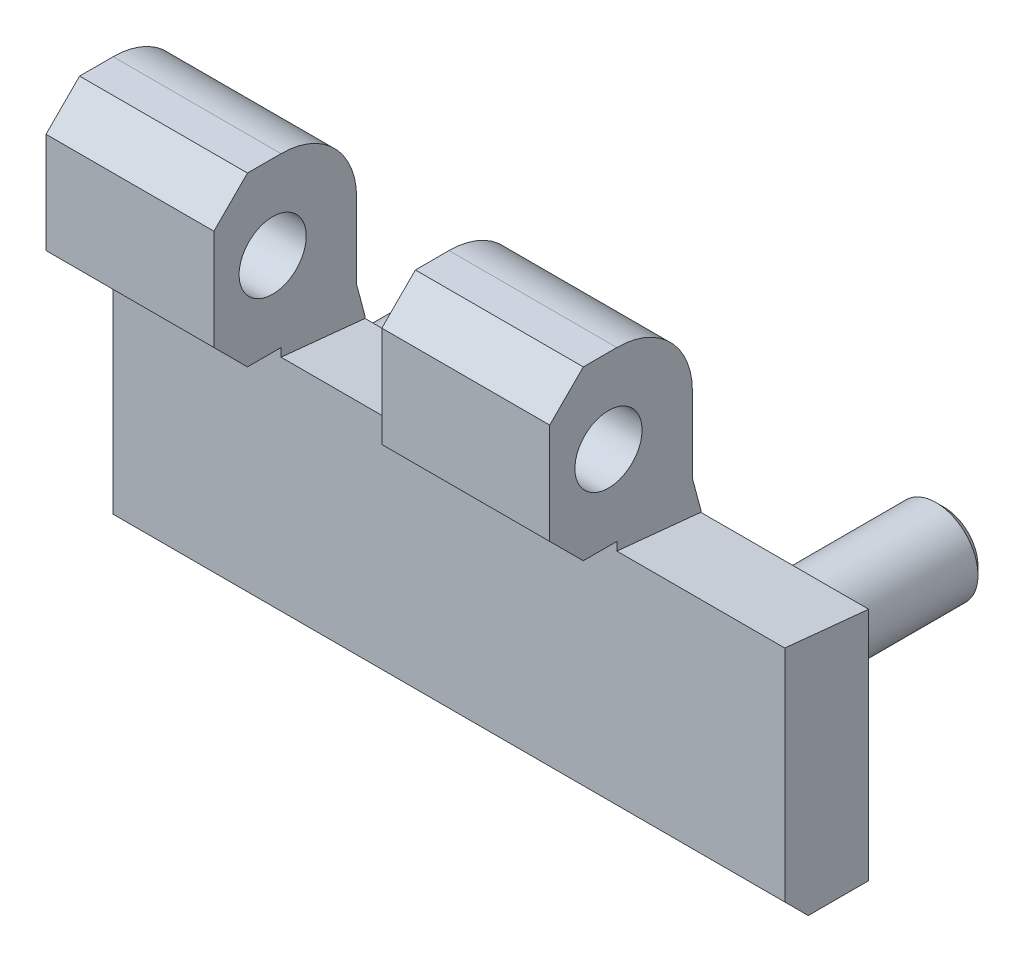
ISO-10303-21;
HEADER;
FILE_DESCRIPTION(('STEP AP214'),'2;1');
FILE_NAME('part.step','',(''),(''),'','','');
FILE_SCHEMA(('AUTOMOTIVE_DESIGN { 1 0 10303 214 1 1 1 1 }'));
ENDSEC;
DATA;
#1=APPLICATION_CONTEXT('core data for automotive mechanical design processes');
#2=APPLICATION_PROTOCOL_DEFINITION('international standard','automotive_design',2000,#1);
#3=PRODUCT_CONTEXT('',#1,'mechanical');
#4=PRODUCT('Part','Part','',(#3));
#5=PRODUCT_RELATED_PRODUCT_CATEGORY('part','',(#4));
#6=PRODUCT_DEFINITION_FORMATION('','',#4);
#7=PRODUCT_DEFINITION_CONTEXT('part definition',#1,'design');
#8=PRODUCT_DEFINITION('design','',#6,#7);
#9=PRODUCT_DEFINITION_SHAPE('','',#8);
#10=(LENGTH_UNIT() NAMED_UNIT(*) SI_UNIT(.MILLI.,.METRE.));
#11=(NAMED_UNIT(*) PLANE_ANGLE_UNIT() SI_UNIT($,.RADIAN.));
#12=(NAMED_UNIT(*) SI_UNIT($,.STERADIAN.) SOLID_ANGLE_UNIT());
#13=UNCERTAINTY_MEASURE_WITH_UNIT(LENGTH_MEASURE(1.E-05),#10,'distance_accuracy_value','');
#14=(GEOMETRIC_REPRESENTATION_CONTEXT(3) GLOBAL_UNCERTAINTY_ASSIGNED_CONTEXT((#13)) GLOBAL_UNIT_ASSIGNED_CONTEXT((#10,
#11,#12)) REPRESENTATION_CONTEXT('',''));
#15=CARTESIAN_POINT('',(0.,0.,0.));
#16=DIRECTION('',(0.,0.,1.));
#17=DIRECTION('',(1.,0.,0.));
#18=AXIS2_PLACEMENT_3D('',#15,#16,#17);
#19=CARTESIAN_POINT('',(-7.5,6.5,0.));
#20=DIRECTION('',(0.,0.995037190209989,-0.099503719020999));
#21=DIRECTION('',(0.,0.099503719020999,0.995037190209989));
#22=AXIS2_PLACEMENT_3D('',#19,#20,#21);
#23=PLANE('',#22);
#24=DIRECTION('',(0.,-0.099503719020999,-0.995037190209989));
#25=VECTOR('',#24,1.);
#26=CARTESIAN_POINT('',(2.5,6.5,0.));
#27=LINE('',#26,#25);
#28=CARTESIAN_POINT('',(2.5,7.,5.));
#29=VERTEX_POINT('',#28);
#30=CARTESIAN_POINT('',(2.5,6.5,0.));
#31=VERTEX_POINT('',#30);
#32=EDGE_CURVE('E29',#29,#31,#27,.T.);
#33=ORIENTED_EDGE('',*,*,#32,.F.);
#34=DIRECTION('',(1.,0.,0.));
#35=VECTOR('',#34,1.);
#36=CARTESIAN_POINT('',(-7.5,7.,5.));
#37=LINE('',#36,#35);
#38=CARTESIAN_POINT('',(12.5,7.,5.));
#39=VERTEX_POINT('',#38);
#40=EDGE_CURVE('E403',#29,#39,#37,.T.);
#41=ORIENTED_EDGE('',*,*,#40,.T.);
#42=DIRECTION('',(0.,-0.099503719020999,-0.995037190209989));
#43=VECTOR('',#42,1.);
#44=CARTESIAN_POINT('',(12.5,6.5,0.));
#45=LINE('',#44,#43);
#46=CARTESIAN_POINT('',(12.5,6.5,0.));
#47=VERTEX_POINT('',#46);
#48=EDGE_CURVE('E369',#39,#47,#45,.T.);
#49=ORIENTED_EDGE('',*,*,#48,.T.);
#50=DIRECTION('',(1.,0.,0.));
#51=VECTOR('',#50,1.);
#52=CARTESIAN_POINT('',(-7.5,6.5,0.));
#53=LINE('',#52,#51);
#54=EDGE_CURVE('E36',#31,#47,#53,.T.);
#55=ORIENTED_EDGE('',*,*,#54,.F.);
#56=EDGE_LOOP('',(#33,#41,#49,#55));
#57=FACE_BOUND('',#56,.T.);
#58=ADVANCED_FACE('F14',(#57),#23,.T.);
#59=CARTESIAN_POINT('',(-7.5,-7.5,3.6));
#60=DIRECTION('',(0.,-1.,0.));
#61=DIRECTION('',(1.,0.,0.));
#62=AXIS2_PLACEMENT_3D('',#59,#60,#61);
#63=PLANE('',#62);
#64=DIRECTION('',(1.,0.,0.));
#65=VECTOR('',#64,1.);
#66=CARTESIAN_POINT('',(-7.5,-7.5,0.));
#67=LINE('',#66,#65);
#68=CARTESIAN_POINT('',(-7.5,-7.5,0.));
#69=VERTEX_POINT('',#68);
#70=CARTESIAN_POINT('',(32.5,-7.5,0.));
#71=VERTEX_POINT('',#70);
#72=EDGE_CURVE('E407',#69,#71,#67,.T.);
#73=ORIENTED_EDGE('',*,*,#72,.T.);
#74=DIRECTION('',(0.,0.,-1.));
#75=VECTOR('',#74,1.);
#76=CARTESIAN_POINT('',(32.5,-7.5,3.6));
#77=LINE('',#76,#75);
#78=CARTESIAN_POINT('',(32.5,-7.5,3.6));
#79=VERTEX_POINT('',#78);
#80=EDGE_CURVE('E374',#79,#71,#77,.T.);
#81=ORIENTED_EDGE('',*,*,#80,.F.);
#82=DIRECTION('',(1.,0.,0.));
#83=VECTOR('',#82,1.);
#84=CARTESIAN_POINT('',(-7.5,-7.5,3.6));
#85=LINE('',#84,#83);
#86=CARTESIAN_POINT('',(-7.5,-7.5,3.6));
#87=VERTEX_POINT('',#86);
#88=EDGE_CURVE('E396',#87,#79,#85,.T.);
#89=ORIENTED_EDGE('',*,*,#88,.F.);
#90=DIRECTION('',(0.,0.,-1.));
#91=VECTOR('',#90,1.);
#92=CARTESIAN_POINT('',(-7.5,-7.5,3.6));
#93=LINE('',#92,#91);
#94=EDGE_CURVE('E387',#87,#69,#93,.T.);
#95=ORIENTED_EDGE('',*,*,#94,.T.);
#96=EDGE_LOOP('',(#73,#81,#89,#95));
#97=FACE_BOUND('',#96,.T.);
#98=ADVANCED_FACE('F16',(#97),#63,.T.);
#99=CARTESIAN_POINT('',(-7.5,-7.5,0.));
#100=DIRECTION('',(0.,0.,-1.));
#101=DIRECTION('',(-1.,0.,0.));
#102=AXIS2_PLACEMENT_3D('',#99,#100,#101);
#103=PLANE('',#102);
#104=CARTESIAN_POINT('',(0.,0.,0.));
#105=DIRECTION('',(0.,0.,-1.));
#106=DIRECTION('',(-1.,0.,0.));
#107=AXIS2_PLACEMENT_3D('',#104,#105,#106);
#108=CIRCLE('',#107,2.5);
#109=CARTESIAN_POINT('',(-2.5,0.,0.));
#110=VERTEX_POINT('',#109);
#111=EDGE_CURVE('E9',#110,#110,#108,.T.);
#112=ORIENTED_EDGE('',*,*,#111,.F.);
#113=EDGE_LOOP('',(#112));
#114=FACE_BOUND('',#113,.T.);
#115=CARTESIAN_POINT('',(25.,0.,0.));
#116=DIRECTION('',(0.,0.,-1.));
#117=DIRECTION('',(-1.,0.,0.));
#118=AXIS2_PLACEMENT_3D('',#115,#116,#117);
#119=CIRCLE('',#118,2.5);
#120=CARTESIAN_POINT('',(22.5,0.,0.));
#121=VERTEX_POINT('',#120);
#122=EDGE_CURVE('E22',#121,#121,#119,.T.);
#123=ORIENTED_EDGE('',*,*,#122,.F.);
#124=EDGE_LOOP('',(#123));
#125=FACE_BOUND('',#124,.T.);
#126=DIRECTION('',(0.,1.,0.));
#127=VECTOR('',#126,1.);
#128=CARTESIAN_POINT('',(-7.5,-7.5,0.));
#129=LINE('',#128,#127);
#130=CARTESIAN_POINT('',(-7.5,6.6339745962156,0.));
#131=VERTEX_POINT('',#130);
#132=EDGE_CURVE('E194',#69,#131,#129,.T.);
#133=ORIENTED_EDGE('',*,*,#132,.T.);
#134=DIRECTION('',(1.,0.,0.));
#135=VECTOR('',#134,1.);
#136=CARTESIAN_POINT('',(-7.5,6.6339745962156,0.));
#137=LINE('',#136,#135);
#138=CARTESIAN_POINT('',(2.5,6.6339745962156,0.));
#139=VERTEX_POINT('',#138);
#140=EDGE_CURVE('E191',#131,#139,#137,.T.);
#141=ORIENTED_EDGE('',*,*,#140,.T.);
#142=DIRECTION('',(0.,1.,0.));
#143=VECTOR('',#142,1.);
#144=CARTESIAN_POINT('',(2.5,4.5,0.));
#145=LINE('',#144,#143);
#146=EDGE_CURVE('E180',#31,#139,#145,.T.);
#147=ORIENTED_EDGE('',*,*,#146,.F.);
#148=ORIENTED_EDGE('',*,*,#54,.T.);
#149=DIRECTION('',(0.,1.,0.));
#150=VECTOR('',#149,1.);
#151=CARTESIAN_POINT('',(12.5,4.5,0.));
#152=LINE('',#151,#150);
#153=CARTESIAN_POINT('',(12.5,6.6339745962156,0.));
#154=VERTEX_POINT('',#153);
#155=EDGE_CURVE('E284',#47,#154,#152,.T.);
#156=ORIENTED_EDGE('',*,*,#155,.T.);
#157=DIRECTION('',(-1.,0.,0.));
#158=VECTOR('',#157,1.);
#159=CARTESIAN_POINT('',(22.5,6.6339745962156,0.));
#160=LINE('',#159,#158);
#161=CARTESIAN_POINT('',(22.5,6.6339745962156,0.));
#162=VERTEX_POINT('',#161);
#163=EDGE_CURVE('E366',#162,#154,#160,.T.);
#164=ORIENTED_EDGE('',*,*,#163,.F.);
#165=DIRECTION('',(0.,1.,0.));
#166=VECTOR('',#165,1.);
#167=CARTESIAN_POINT('',(22.5,4.5,0.));
#168=LINE('',#167,#166);
#169=CARTESIAN_POINT('',(22.5,6.5,0.));
#170=VERTEX_POINT('',#169);
#171=EDGE_CURVE('E319',#170,#162,#168,.T.);
#172=ORIENTED_EDGE('',*,*,#171,.F.);
#173=CARTESIAN_POINT('',(32.5,6.5,0.));
#174=VERTEX_POINT('',#173);
#175=EDGE_CURVE('E405',#170,#174,#53,.T.);
#176=ORIENTED_EDGE('',*,*,#175,.T.);
#177=DIRECTION('',(0.,1.,0.));
#178=VECTOR('',#177,1.);
#179=CARTESIAN_POINT('',(32.5,-7.5,0.));
#180=LINE('',#179,#178);
#181=EDGE_CURVE('E375',#71,#174,#180,.T.);
#182=ORIENTED_EDGE('',*,*,#181,.F.);
#183=ORIENTED_EDGE('',*,*,#72,.F.);
#184=EDGE_LOOP('',(#133,#141,#147,#148,#156,#164,#172,#176,#182,#183));
#185=FACE_BOUND('',#184,.T.);
#186=ADVANCED_FACE('F192',(#114,#125,#185),#103,.T.);
#187=DIRECTION('',(0.,-0.099503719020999,-0.995037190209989));
#188=VECTOR('',#187,1.);
#189=CARTESIAN_POINT('',(22.5,6.5,0.));
#190=LINE('',#189,#188);
#191=CARTESIAN_POINT('',(22.5,7.,5.));
#192=VERTEX_POINT('',#191);
#193=EDGE_CURVE('E372',#192,#170,#190,.T.);
#194=ORIENTED_EDGE('',*,*,#193,.F.);
#195=CARTESIAN_POINT('',(32.5,7.,5.));
#196=VERTEX_POINT('',#195);
#197=EDGE_CURVE('E402',#192,#196,#37,.T.);
#198=ORIENTED_EDGE('',*,*,#197,.T.);
#199=DIRECTION('',(0.,0.099503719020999,0.995037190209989));
#200=VECTOR('',#199,1.);
#201=CARTESIAN_POINT('',(32.5,6.5,0.));
#202=LINE('',#201,#200);
#203=EDGE_CURVE('E378',#174,#196,#202,.T.);
#204=ORIENTED_EDGE('',*,*,#203,.F.);
#205=ORIENTED_EDGE('',*,*,#175,.F.);
#206=EDGE_LOOP('',(#194,#198,#204,#205));
#207=FACE_BOUND('',#206,.T.);
#208=ADVANCED_FACE('F414',(#207),#23,.T.);
#209=CARTESIAN_POINT('',(-7.5,7.,5.));
#210=DIRECTION('',(0.,0.,1.));
#211=DIRECTION('',(1.,0.,0.));
#212=AXIS2_PLACEMENT_3D('',#209,#210,#211);
#213=PLANE('',#212);
#214=DIRECTION('',(0.,-1.,0.));
#215=VECTOR('',#214,1.);
#216=CARTESIAN_POINT('',(-7.5,7.,5.));
#217=LINE('',#216,#215);
#218=CARTESIAN_POINT('',(-7.5,7.5,5.));
#219=VERTEX_POINT('',#218);
#220=CARTESIAN_POINT('',(-7.5,-6.1,5.));
#221=VERTEX_POINT('',#220);
#222=EDGE_CURVE('E391',#219,#221,#217,.T.);
#223=ORIENTED_EDGE('',*,*,#222,.T.);
#224=DIRECTION('',(1.,0.,0.));
#225=VECTOR('',#224,1.);
#226=CARTESIAN_POINT('',(-7.5,-6.1,5.));
#227=LINE('',#226,#225);
#228=CARTESIAN_POINT('',(32.5,-6.1,5.));
#229=VERTEX_POINT('',#228);
#230=EDGE_CURVE('E400',#221,#229,#227,.T.);
#231=ORIENTED_EDGE('',*,*,#230,.T.);
#232=DIRECTION('',(0.,-1.,0.));
#233=VECTOR('',#232,1.);
#234=CARTESIAN_POINT('',(32.5,7.,5.));
#235=LINE('',#234,#233);
#236=EDGE_CURVE('E381',#196,#229,#235,.T.);
#237=ORIENTED_EDGE('',*,*,#236,.F.);
#238=ORIENTED_EDGE('',*,*,#197,.F.);
#239=DIRECTION('',(0.,-1.,0.));
#240=VECTOR('',#239,1.);
#241=CARTESIAN_POINT('',(22.5,7.5,5.));
#242=LINE('',#241,#240);
#243=CARTESIAN_POINT('',(22.5,7.5,5.));
#244=VERTEX_POINT('',#243);
#245=EDGE_CURVE('E337',#244,#192,#242,.T.);
#246=ORIENTED_EDGE('',*,*,#245,.F.);
#247=DIRECTION('',(-1.,0.,0.));
#248=VECTOR('',#247,1.);
#249=CARTESIAN_POINT('',(22.5,7.5,5.));
#250=LINE('',#249,#248);
#251=CARTESIAN_POINT('',(12.5,7.5,5.));
#252=VERTEX_POINT('',#251);
#253=EDGE_CURVE('E342',#244,#252,#250,.T.);
#254=ORIENTED_EDGE('',*,*,#253,.T.);
#255=DIRECTION('',(0.,-1.,0.));
#256=VECTOR('',#255,1.);
#257=CARTESIAN_POINT('',(12.5,7.5,5.));
#258=LINE('',#257,#256);
#259=EDGE_CURVE('E311',#252,#39,#258,.T.);
#260=ORIENTED_EDGE('',*,*,#259,.T.);
#261=ORIENTED_EDGE('',*,*,#40,.F.);
#262=DIRECTION('',(0.,-1.,0.));
#263=VECTOR('',#262,1.);
#264=CARTESIAN_POINT('',(2.5,7.5,5.));
#265=LINE('',#264,#263);
#266=CARTESIAN_POINT('',(2.5,7.5,5.));
#267=VERTEX_POINT('',#266);
#268=EDGE_CURVE('E235',#267,#29,#265,.T.);
#269=ORIENTED_EDGE('',*,*,#268,.F.);
#270=DIRECTION('',(1.,0.,0.));
#271=VECTOR('',#270,1.);
#272=CARTESIAN_POINT('',(-7.5,7.5,5.));
#273=LINE('',#272,#271);
#274=EDGE_CURVE('E268',#219,#267,#273,.T.);
#275=ORIENTED_EDGE('',*,*,#274,.F.);
#276=EDGE_LOOP('',(#223,#231,#237,#238,#246,#254,#260,#261,#269,#275));
#277=FACE_BOUND('',#276,.T.);
#278=ADVANCED_FACE('F422',(#277),#213,.T.);
#279=CARTESIAN_POINT('',(-7.5,-6.1,5.));
#280=DIRECTION('',(0.,-0.707106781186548,0.707106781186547));
#281=DIRECTION('',(0.,-0.707106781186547,-0.707106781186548));
#282=AXIS2_PLACEMENT_3D('',#279,#280,#281);
#283=PLANE('',#282);
#284=ORIENTED_EDGE('',*,*,#88,.T.);
#285=DIRECTION('',(0.,-0.707106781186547,-0.707106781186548));
#286=VECTOR('',#285,1.);
#287=CARTESIAN_POINT('',(32.5,-6.1,5.));
#288=LINE('',#287,#286);
#289=EDGE_CURVE('E384',#229,#79,#288,.T.);
#290=ORIENTED_EDGE('',*,*,#289,.F.);
#291=ORIENTED_EDGE('',*,*,#230,.F.);
#292=DIRECTION('',(0.,-0.707106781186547,-0.707106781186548));
#293=VECTOR('',#292,1.);
#294=CARTESIAN_POINT('',(-7.5,-6.1,5.));
#295=LINE('',#294,#293);
#296=EDGE_CURVE('E393',#221,#87,#295,.T.);
#297=ORIENTED_EDGE('',*,*,#296,.T.);
#298=EDGE_LOOP('',(#284,#290,#291,#297));
#299=FACE_BOUND('',#298,.T.);
#300=ADVANCED_FACE('F434',(#299),#283,.T.);
#301=CARTESIAN_POINT('',(-7.5,-7.5,0.));
#302=DIRECTION('',(1.,0.,0.));
#303=DIRECTION('',(0.,1.,0.));
#304=AXIS2_PLACEMENT_3D('',#301,#302,#303);
#305=PLANE('',#304);
#306=ORIENTED_EDGE('',*,*,#296,.F.);
#307=ORIENTED_EDGE('',*,*,#222,.F.);
#308=DIRECTION('',(0.,0.,-1.));
#309=VECTOR('',#308,1.);
#310=CARTESIAN_POINT('',(-7.5,7.5,7.));
#311=LINE('',#310,#309);
#312=CARTESIAN_POINT('',(-7.5,7.5,7.));
#313=VERTEX_POINT('',#312);
#314=EDGE_CURVE('E262',#313,#219,#311,.T.);
#315=ORIENTED_EDGE('',*,*,#314,.F.);
#316=DIRECTION('',(0.,-0.707106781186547,-0.707106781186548));
#317=VECTOR('',#316,1.);
#318=CARTESIAN_POINT('',(-7.5,9.5,9.));
#319=LINE('',#318,#317);
#320=CARTESIAN_POINT('',(-7.5,9.5,9.));
#321=VERTEX_POINT('',#320);
#322=EDGE_CURVE('E259',#321,#313,#319,.T.);
#323=ORIENTED_EDGE('',*,*,#322,.F.);
#324=DIRECTION('',(0.,-1.,0.));
#325=VECTOR('',#324,1.);
#326=CARTESIAN_POINT('',(-7.5,15.5,9.));
#327=LINE('',#326,#325);
#328=CARTESIAN_POINT('',(-7.5,15.5,9.));
#329=VERTEX_POINT('',#328);
#330=EDGE_CURVE('E256',#329,#321,#327,.T.);
#331=ORIENTED_EDGE('',*,*,#330,.F.);
#332=DIRECTION('',(0.,-0.707106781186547,0.707106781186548));
#333=VECTOR('',#332,1.);
#334=CARTESIAN_POINT('',(-7.5,17.5,7.));
#335=LINE('',#334,#333);
#336=CARTESIAN_POINT('',(-7.5,17.5,7.));
#337=VERTEX_POINT('',#336);
#338=EDGE_CURVE('E253',#337,#329,#335,.T.);
#339=ORIENTED_EDGE('',*,*,#338,.F.);
#340=DIRECTION('',(0.,0.,1.));
#341=VECTOR('',#340,1.);
#342=CARTESIAN_POINT('',(-7.5,17.5,5.));
#343=LINE('',#342,#341);
#344=CARTESIAN_POINT('',(-7.5,17.5,5.));
#345=VERTEX_POINT('',#344);
#346=EDGE_CURVE('E250',#345,#337,#343,.T.);
#347=ORIENTED_EDGE('',*,*,#346,.F.);
#348=CARTESIAN_POINT('',(-7.5,13.0000000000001,4.99999999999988));
#349=DIRECTION('',(1.,0.,0.));
#350=DIRECTION('',(0.,-1.,0.));
#351=AXIS2_PLACEMENT_3D('',#348,#349,#350);
#352=CIRCLE('',#351,4.49999999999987);
#353=CARTESIAN_POINT('',(-7.5,13.,0.5));
#354=VERTEX_POINT('',#353);
#355=EDGE_CURVE('E247',#354,#345,#352,.T.);
#356=ORIENTED_EDGE('',*,*,#355,.F.);
#357=DIRECTION('',(0.,1.,0.));
#358=VECTOR('',#357,1.);
#359=CARTESIAN_POINT('',(-7.5,8.5,0.5));
#360=LINE('',#359,#358);
#361=CARTESIAN_POINT('',(-7.5,8.5,0.5));
#362=VERTEX_POINT('',#361);
#363=EDGE_CURVE('E244',#362,#354,#360,.T.);
#364=ORIENTED_EDGE('',*,*,#363,.F.);
#365=DIRECTION('',(0.,0.965925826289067,0.258819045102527));
#366=VECTOR('',#365,1.);
#367=CARTESIAN_POINT('',(-7.5,6.6339745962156,0.));
#368=LINE('',#367,#366);
#369=EDGE_CURVE('E242',#131,#362,#368,.T.);
#370=ORIENTED_EDGE('',*,*,#369,.F.);
#371=ORIENTED_EDGE('',*,*,#132,.F.);
#372=ORIENTED_EDGE('',*,*,#94,.F.);
#373=EDGE_LOOP('',(#306,#307,#315,#323,#331,#339,#347,#356,#364,#370,#371,#372));
#374=FACE_BOUND('',#373,.T.);
#375=CARTESIAN_POINT('',(-7.5,12.5,5.5));
#376=DIRECTION('',(1.,0.,0.));
#377=DIRECTION('',(0.,1.,0.));
#378=AXIS2_PLACEMENT_3D('',#375,#376,#377);
#379=CIRCLE('',#378,2.);
#380=CARTESIAN_POINT('',(-7.5,14.5,5.5));
#381=VERTEX_POINT('',#380);
#382=EDGE_CURVE('E265',#381,#381,#379,.T.);
#383=ORIENTED_EDGE('',*,*,#382,.T.);
#384=EDGE_LOOP('',(#383));
#385=FACE_BOUND('',#384,.T.);
#386=ADVANCED_FACE('F438',(#374,#385),#305,.F.);
#387=CARTESIAN_POINT('',(32.5,-7.5,0.));
#388=DIRECTION('',(1.,0.,0.));
#389=DIRECTION('',(0.,1.,0.));
#390=AXIS2_PLACEMENT_3D('',#387,#388,#389);
#391=PLANE('',#390);
#392=ORIENTED_EDGE('',*,*,#80,.T.);
#393=ORIENTED_EDGE('',*,*,#181,.T.);
#394=ORIENTED_EDGE('',*,*,#203,.T.);
#395=ORIENTED_EDGE('',*,*,#236,.T.);
#396=ORIENTED_EDGE('',*,*,#289,.T.);
#397=EDGE_LOOP('',(#392,#393,#394,#395,#396));
#398=FACE_BOUND('',#397,.T.);
#399=ADVANCED_FACE('F442',(#398),#391,.T.);
#400=CARTESIAN_POINT('',(22.5,6.6339745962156,0.));
#401=DIRECTION('',(0.,-0.258819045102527,0.965925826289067));
#402=DIRECTION('',(0.,-0.965925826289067,-0.258819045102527));
#403=AXIS2_PLACEMENT_3D('',#400,#401,#402);
#404=PLANE('',#403);
#405=DIRECTION('',(0.,0.965925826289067,0.258819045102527));
#406=VECTOR('',#405,1.);
#407=CARTESIAN_POINT('',(12.5,6.6339745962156,0.));
#408=LINE('',#407,#406);
#409=CARTESIAN_POINT('',(12.5,8.5,0.5));
#410=VERTEX_POINT('',#409);
#411=EDGE_CURVE('E287',#154,#410,#408,.T.);
#412=ORIENTED_EDGE('',*,*,#411,.T.);
#413=DIRECTION('',(-1.,0.,0.));
#414=VECTOR('',#413,1.);
#415=CARTESIAN_POINT('',(22.5,8.5,0.5));
#416=LINE('',#415,#414);
#417=CARTESIAN_POINT('',(22.5,8.5,0.5));
#418=VERTEX_POINT('',#417);
#419=EDGE_CURVE('E363',#418,#410,#416,.T.);
#420=ORIENTED_EDGE('',*,*,#419,.F.);
#421=DIRECTION('',(0.,0.965925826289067,0.258819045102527));
#422=VECTOR('',#421,1.);
#423=CARTESIAN_POINT('',(22.5,6.6339745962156,0.));
#424=LINE('',#423,#422);
#425=EDGE_CURVE('E321',#162,#418,#424,.T.);
#426=ORIENTED_EDGE('',*,*,#425,.F.);
#427=ORIENTED_EDGE('',*,*,#163,.T.);
#428=EDGE_LOOP('',(#412,#420,#426,#427));
#429=FACE_BOUND('',#428,.T.);
#430=ADVANCED_FACE('F446',(#429),#404,.F.);
#431=CARTESIAN_POINT('',(22.5,8.5,0.5));
#432=DIRECTION('',(0.,0.,1.));
#433=DIRECTION('',(1.,0.,0.));
#434=AXIS2_PLACEMENT_3D('',#431,#432,#433);
#435=PLANE('',#434);
#436=DIRECTION('',(0.,1.,0.));
#437=VECTOR('',#436,1.);
#438=CARTESIAN_POINT('',(12.5,8.5,0.5));
#439=LINE('',#438,#437);
#440=CARTESIAN_POINT('',(12.5,13.,0.5));
#441=VERTEX_POINT('',#440);
#442=EDGE_CURVE('E290',#410,#441,#439,.T.);
#443=ORIENTED_EDGE('',*,*,#442,.T.);
#444=DIRECTION('',(-1.,0.,0.));
#445=VECTOR('',#444,1.);
#446=CARTESIAN_POINT('',(22.5,13.,0.5));
#447=LINE('',#446,#445);
#448=CARTESIAN_POINT('',(22.5,13.,0.5));
#449=VERTEX_POINT('',#448);
#450=EDGE_CURVE('E360',#449,#441,#447,.T.);
#451=ORIENTED_EDGE('',*,*,#450,.F.);
#452=DIRECTION('',(0.,1.,0.));
#453=VECTOR('',#452,1.);
#454=CARTESIAN_POINT('',(22.5,8.5,0.5));
#455=LINE('',#454,#453);
#456=EDGE_CURVE('E323',#418,#449,#455,.T.);
#457=ORIENTED_EDGE('',*,*,#456,.F.);
#458=ORIENTED_EDGE('',*,*,#419,.T.);
#459=EDGE_LOOP('',(#443,#451,#457,#458));
#460=FACE_BOUND('',#459,.T.);
#461=ADVANCED_FACE('F450',(#460),#435,.F.);
#462=CARTESIAN_POINT('',(22.5,13.0000000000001,4.99999999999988));
#463=DIRECTION('',(-1.,0.,0.));
#464=DIRECTION('',(0.,-1.,0.));
#465=AXIS2_PLACEMENT_3D('',#462,#463,#464);
#466=CYLINDRICAL_SURFACE('',#465,4.49999999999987);
#467=CARTESIAN_POINT('',(12.5,13.0000000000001,4.99999999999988));
#468=DIRECTION('',(1.,0.,0.));
#469=DIRECTION('',(0.,-1.,0.));
#470=AXIS2_PLACEMENT_3D('',#467,#468,#469);
#471=CIRCLE('',#470,4.49999999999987);
#472=CARTESIAN_POINT('',(12.5,17.5,5.));
#473=VERTEX_POINT('',#472);
#474=EDGE_CURVE('E293',#441,#473,#471,.T.);
#475=ORIENTED_EDGE('',*,*,#474,.T.);
#476=DIRECTION('',(-1.,0.,0.));
#477=VECTOR('',#476,1.);
#478=CARTESIAN_POINT('',(22.5,17.5,5.));
#479=LINE('',#478,#477);
#480=CARTESIAN_POINT('',(22.5,17.5,5.));
#481=VERTEX_POINT('',#480);
#482=EDGE_CURVE('E357',#481,#473,#479,.T.);
#483=ORIENTED_EDGE('',*,*,#482,.F.);
#484=CARTESIAN_POINT('',(22.5,13.0000000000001,4.99999999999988));
#485=DIRECTION('',(1.,0.,0.));
#486=DIRECTION('',(0.,-1.,0.));
#487=AXIS2_PLACEMENT_3D('',#484,#485,#486);
#488=CIRCLE('',#487,4.49999999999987);
#489=EDGE_CURVE('E325',#449,#481,#488,.T.);
#490=ORIENTED_EDGE('',*,*,#489,.F.);
#491=ORIENTED_EDGE('',*,*,#450,.T.);
#492=EDGE_LOOP('',(#475,#483,#490,#491));
#493=FACE_BOUND('',#492,.T.);
#494=ADVANCED_FACE('F454',(#493),#466,.T.);
#495=CARTESIAN_POINT('',(22.5,17.5,5.));
#496=DIRECTION('',(0.,-1.,0.));
#497=DIRECTION('',(1.,0.,0.));
#498=AXIS2_PLACEMENT_3D('',#495,#496,#497);
#499=PLANE('',#498);
#500=DIRECTION('',(0.,0.,1.));
#501=VECTOR('',#500,1.);
#502=CARTESIAN_POINT('',(12.5,17.5,5.));
#503=LINE('',#502,#501);
#504=CARTESIAN_POINT('',(12.5,17.5,7.));
#505=VERTEX_POINT('',#504);
#506=EDGE_CURVE('E296',#473,#505,#503,.T.);
#507=ORIENTED_EDGE('',*,*,#506,.T.);
#508=DIRECTION('',(-1.,0.,0.));
#509=VECTOR('',#508,1.);
#510=CARTESIAN_POINT('',(22.5,17.5,7.));
#511=LINE('',#510,#509);
#512=CARTESIAN_POINT('',(22.5,17.5,7.));
#513=VERTEX_POINT('',#512);
#514=EDGE_CURVE('E354',#513,#505,#511,.T.);
#515=ORIENTED_EDGE('',*,*,#514,.F.);
#516=DIRECTION('',(0.,0.,1.));
#517=VECTOR('',#516,1.);
#518=CARTESIAN_POINT('',(22.5,17.5,5.));
#519=LINE('',#518,#517);
#520=EDGE_CURVE('E327',#481,#513,#519,.T.);
#521=ORIENTED_EDGE('',*,*,#520,.F.);
#522=ORIENTED_EDGE('',*,*,#482,.T.);
#523=EDGE_LOOP('',(#507,#515,#521,#522));
#524=FACE_BOUND('',#523,.T.);
#525=ADVANCED_FACE('F458',(#524),#499,.F.);
#526=CARTESIAN_POINT('',(22.5,17.5,7.));
#527=DIRECTION('',(0.,-0.707106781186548,-0.707106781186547));
#528=DIRECTION('',(0.,0.707106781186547,-0.707106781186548));
#529=AXIS2_PLACEMENT_3D('',#526,#527,#528);
#530=PLANE('',#529);
#531=DIRECTION('',(0.,-0.707106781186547,0.707106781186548));
#532=VECTOR('',#531,1.);
#533=CARTESIAN_POINT('',(12.5,17.5,7.));
#534=LINE('',#533,#532);
#535=CARTESIAN_POINT('',(12.5,15.5,9.));
#536=VERTEX_POINT('',#535);
#537=EDGE_CURVE('E299',#505,#536,#534,.T.);
#538=ORIENTED_EDGE('',*,*,#537,.T.);
#539=DIRECTION('',(-1.,0.,0.));
#540=VECTOR('',#539,1.);
#541=CARTESIAN_POINT('',(22.5,15.5,9.));
#542=LINE('',#541,#540);
#543=CARTESIAN_POINT('',(22.5,15.5,9.));
#544=VERTEX_POINT('',#543);
#545=EDGE_CURVE('E351',#544,#536,#542,.T.);
#546=ORIENTED_EDGE('',*,*,#545,.F.);
#547=DIRECTION('',(0.,-0.707106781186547,0.707106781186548));
#548=VECTOR('',#547,1.);
#549=CARTESIAN_POINT('',(22.5,17.5,7.));
#550=LINE('',#549,#548);
#551=EDGE_CURVE('E329',#513,#544,#550,.T.);
#552=ORIENTED_EDGE('',*,*,#551,.F.);
#553=ORIENTED_EDGE('',*,*,#514,.T.);
#554=EDGE_LOOP('',(#538,#546,#552,#553));
#555=FACE_BOUND('',#554,.T.);
#556=ADVANCED_FACE('F462',(#555),#530,.F.);
#557=CARTESIAN_POINT('',(22.5,15.5,9.));
#558=DIRECTION('',(0.,0.,-1.));
#559=DIRECTION('',(-1.,0.,0.));
#560=AXIS2_PLACEMENT_3D('',#557,#558,#559);
#561=PLANE('',#560);
#562=DIRECTION('',(0.,-1.,0.));
#563=VECTOR('',#562,1.);
#564=CARTESIAN_POINT('',(12.5,15.5,9.));
#565=LINE('',#564,#563);
#566=CARTESIAN_POINT('',(12.5,9.5,9.));
#567=VERTEX_POINT('',#566);
#568=EDGE_CURVE('E302',#536,#567,#565,.T.);
#569=ORIENTED_EDGE('',*,*,#568,.T.);
#570=DIRECTION('',(-1.,0.,0.));
#571=VECTOR('',#570,1.);
#572=CARTESIAN_POINT('',(22.5,9.5,9.));
#573=LINE('',#572,#571);
#574=CARTESIAN_POINT('',(22.5,9.5,9.));
#575=VERTEX_POINT('',#574);
#576=EDGE_CURVE('E348',#575,#567,#573,.T.);
#577=ORIENTED_EDGE('',*,*,#576,.F.);
#578=DIRECTION('',(0.,-1.,0.));
#579=VECTOR('',#578,1.);
#580=CARTESIAN_POINT('',(22.5,15.5,9.));
#581=LINE('',#580,#579);
#582=EDGE_CURVE('E331',#544,#575,#581,.T.);
#583=ORIENTED_EDGE('',*,*,#582,.F.);
#584=ORIENTED_EDGE('',*,*,#545,.T.);
#585=EDGE_LOOP('',(#569,#577,#583,#584));
#586=FACE_BOUND('',#585,.T.);
#587=ADVANCED_FACE('F466',(#586),#561,.F.);
#588=CARTESIAN_POINT('',(22.5,9.5,9.));
#589=DIRECTION('',(0.,0.707106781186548,-0.707106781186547));
#590=DIRECTION('',(0.,0.707106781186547,0.707106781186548));
#591=AXIS2_PLACEMENT_3D('',#588,#589,#590);
#592=PLANE('',#591);
#593=DIRECTION('',(0.,-0.707106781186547,-0.707106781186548));
#594=VECTOR('',#593,1.);
#595=CARTESIAN_POINT('',(12.5,9.5,9.));
#596=LINE('',#595,#594);
#597=CARTESIAN_POINT('',(12.5,7.5,7.));
#598=VERTEX_POINT('',#597);
#599=EDGE_CURVE('E305',#567,#598,#596,.T.);
#600=ORIENTED_EDGE('',*,*,#599,.T.);
#601=DIRECTION('',(-1.,0.,0.));
#602=VECTOR('',#601,1.);
#603=CARTESIAN_POINT('',(22.5,7.5,7.));
#604=LINE('',#603,#602);
#605=CARTESIAN_POINT('',(22.5,7.5,7.));
#606=VERTEX_POINT('',#605);
#607=EDGE_CURVE('E345',#606,#598,#604,.T.);
#608=ORIENTED_EDGE('',*,*,#607,.F.);
#609=DIRECTION('',(0.,-0.707106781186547,-0.707106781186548));
#610=VECTOR('',#609,1.);
#611=CARTESIAN_POINT('',(22.5,9.5,9.));
#612=LINE('',#611,#610);
#613=EDGE_CURVE('E333',#575,#606,#612,.T.);
#614=ORIENTED_EDGE('',*,*,#613,.F.);
#615=ORIENTED_EDGE('',*,*,#576,.T.);
#616=EDGE_LOOP('',(#600,#608,#614,#615));
#617=FACE_BOUND('',#616,.T.);
#618=ADVANCED_FACE('F470',(#617),#592,.F.);
#619=CARTESIAN_POINT('',(22.5,7.5,7.));
#620=DIRECTION('',(0.,1.,0.));
#621=DIRECTION('',(-1.,0.,0.));
#622=AXIS2_PLACEMENT_3D('',#619,#620,#621);
#623=PLANE('',#622);
#624=DIRECTION('',(0.,0.,-1.));
#625=VECTOR('',#624,1.);
#626=CARTESIAN_POINT('',(12.5,7.5,7.));
#627=LINE('',#626,#625);
#628=EDGE_CURVE('E308',#598,#252,#627,.T.);
#629=ORIENTED_EDGE('',*,*,#628,.T.);
#630=ORIENTED_EDGE('',*,*,#253,.F.);
#631=DIRECTION('',(0.,0.,-1.));
#632=VECTOR('',#631,1.);
#633=CARTESIAN_POINT('',(22.5,7.5,7.));
#634=LINE('',#633,#632);
#635=EDGE_CURVE('E335',#606,#244,#634,.T.);
#636=ORIENTED_EDGE('',*,*,#635,.F.);
#637=ORIENTED_EDGE('',*,*,#607,.T.);
#638=EDGE_LOOP('',(#629,#630,#636,#637));
#639=FACE_BOUND('',#638,.T.);
#640=ADVANCED_FACE('F474',(#639),#623,.F.);
#641=CARTESIAN_POINT('',(22.5,12.5,5.5));
#642=DIRECTION('',(-1.,0.,0.));
#643=DIRECTION('',(0.,-1.,0.));
#644=AXIS2_PLACEMENT_3D('',#641,#642,#643);
#645=CYLINDRICAL_SURFACE('',#644,2.);
#646=CARTESIAN_POINT('',(22.5,12.5,5.5));
#647=DIRECTION('',(1.,0.,0.));
#648=DIRECTION('',(0.,1.,0.));
#649=AXIS2_PLACEMENT_3D('',#646,#647,#648);
#650=CIRCLE('',#649,2.);
#651=CARTESIAN_POINT('',(22.5,14.5,5.5));
#652=VERTEX_POINT('',#651);
#653=EDGE_CURVE('E339',#652,#652,#650,.T.);
#654=ORIENTED_EDGE('',*,*,#653,.T.);
#655=EDGE_LOOP('',(#654));
#656=FACE_BOUND('',#655,.T.);
#657=CARTESIAN_POINT('',(12.5,12.5,5.5));
#658=DIRECTION('',(1.,0.,0.));
#659=DIRECTION('',(0.,1.,0.));
#660=AXIS2_PLACEMENT_3D('',#657,#658,#659);
#661=CIRCLE('',#660,2.);
#662=CARTESIAN_POINT('',(12.5,14.5,5.5));
#663=VERTEX_POINT('',#662);
#664=EDGE_CURVE('E315',#663,#663,#661,.T.);
#665=ORIENTED_EDGE('',*,*,#664,.F.);
#666=EDGE_LOOP('',(#665));
#667=FACE_BOUND('',#666,.T.);
#668=ADVANCED_FACE('F478',(#656,#667),#645,.F.);
#669=CARTESIAN_POINT('',(22.5,13.0000000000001,4.99999999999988));
#670=DIRECTION('',(1.,0.,0.));
#671=DIRECTION('',(0.,1.,0.));
#672=AXIS2_PLACEMENT_3D('',#669,#670,#671);
#673=PLANE('',#672);
#674=ORIENTED_EDGE('',*,*,#653,.F.);
#675=EDGE_LOOP('',(#674));
#676=FACE_BOUND('',#675,.T.);
#677=ORIENTED_EDGE('',*,*,#245,.T.);
#678=ORIENTED_EDGE('',*,*,#193,.T.);
#679=ORIENTED_EDGE('',*,*,#171,.T.);
#680=ORIENTED_EDGE('',*,*,#425,.T.);
#681=ORIENTED_EDGE('',*,*,#456,.T.);
#682=ORIENTED_EDGE('',*,*,#489,.T.);
#683=ORIENTED_EDGE('',*,*,#520,.T.);
#684=ORIENTED_EDGE('',*,*,#551,.T.);
#685=ORIENTED_EDGE('',*,*,#582,.T.);
#686=ORIENTED_EDGE('',*,*,#613,.T.);
#687=ORIENTED_EDGE('',*,*,#635,.T.);
#688=EDGE_LOOP('',(#677,#678,#679,#680,#681,#682,#683,#684,#685,#686,#687));
#689=FACE_BOUND('',#688,.T.);
#690=ADVANCED_FACE('F482',(#676,#689),#673,.T.);
#691=CARTESIAN_POINT('',(12.5,13.0000000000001,4.99999999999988));
#692=DIRECTION('',(1.,0.,0.));
#693=DIRECTION('',(0.,1.,0.));
#694=AXIS2_PLACEMENT_3D('',#691,#692,#693);
#695=PLANE('',#694);
#696=ORIENTED_EDGE('',*,*,#48,.F.);
#697=ORIENTED_EDGE('',*,*,#259,.F.);
#698=ORIENTED_EDGE('',*,*,#628,.F.);
#699=ORIENTED_EDGE('',*,*,#599,.F.);
#700=ORIENTED_EDGE('',*,*,#568,.F.);
#701=ORIENTED_EDGE('',*,*,#537,.F.);
#702=ORIENTED_EDGE('',*,*,#506,.F.);
#703=ORIENTED_EDGE('',*,*,#474,.F.);
#704=ORIENTED_EDGE('',*,*,#442,.F.);
#705=ORIENTED_EDGE('',*,*,#411,.F.);
#706=ORIENTED_EDGE('',*,*,#155,.F.);
#707=EDGE_LOOP('',(#696,#697,#698,#699,#700,#701,#702,#703,#704,#705,#706));
#708=FACE_BOUND('',#707,.T.);
#709=ORIENTED_EDGE('',*,*,#664,.T.);
#710=EDGE_LOOP('',(#709));
#711=FACE_BOUND('',#710,.T.);
#712=ADVANCED_FACE('F486',(#708,#711),#695,.F.);
#713=CARTESIAN_POINT('',(-7.5,6.6339745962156,0.));
#714=DIRECTION('',(0.,0.258819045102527,-0.965925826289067));
#715=DIRECTION('',(0.,0.965925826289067,0.258819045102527));
#716=AXIS2_PLACEMENT_3D('',#713,#714,#715);
#717=PLANE('',#716);
#718=DIRECTION('',(0.,0.965925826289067,0.258819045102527));
#719=VECTOR('',#718,1.);
#720=CARTESIAN_POINT('',(2.5,6.6339745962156,0.));
#721=LINE('',#720,#719);
#722=CARTESIAN_POINT('',(2.5,8.5,0.5));
#723=VERTEX_POINT('',#722);
#724=EDGE_CURVE('E186',#139,#723,#721,.T.);
#725=ORIENTED_EDGE('',*,*,#724,.F.);
#726=ORIENTED_EDGE('',*,*,#140,.F.);
#727=ORIENTED_EDGE('',*,*,#369,.T.);
#728=DIRECTION('',(1.,0.,0.));
#729=VECTOR('',#728,1.);
#730=CARTESIAN_POINT('',(-7.5,8.5,0.5));
#731=LINE('',#730,#729);
#732=EDGE_CURVE('E198',#362,#723,#731,.T.);
#733=ORIENTED_EDGE('',*,*,#732,.T.);
#734=EDGE_LOOP('',(#725,#726,#727,#733));
#735=FACE_BOUND('',#734,.T.);
#736=ADVANCED_FACE('F200',(#735),#717,.T.);
#737=CARTESIAN_POINT('',(-7.5,8.5,0.5));
#738=DIRECTION('',(0.,0.,-1.));
#739=DIRECTION('',(-1.,0.,0.));
#740=AXIS2_PLACEMENT_3D('',#737,#738,#739);
#741=PLANE('',#740);
#742=DIRECTION('',(0.,1.,0.));
#743=VECTOR('',#742,1.);
#744=CARTESIAN_POINT('',(2.5,8.5,0.5));
#745=LINE('',#744,#743);
#746=CARTESIAN_POINT('',(2.5,13.,0.5));
#747=VERTEX_POINT('',#746);
#748=EDGE_CURVE('E203',#723,#747,#745,.T.);
#749=ORIENTED_EDGE('',*,*,#748,.F.);
#750=ORIENTED_EDGE('',*,*,#732,.F.);
#751=ORIENTED_EDGE('',*,*,#363,.T.);
#752=DIRECTION('',(1.,0.,0.));
#753=VECTOR('',#752,1.);
#754=CARTESIAN_POINT('',(-7.5,13.,0.5));
#755=LINE('',#754,#753);
#756=EDGE_CURVE('E280',#354,#747,#755,.T.);
#757=ORIENTED_EDGE('',*,*,#756,.T.);
#758=EDGE_LOOP('',(#749,#750,#751,#757));
#759=FACE_BOUND('',#758,.T.);
#760=ADVANCED_FACE('F493',(#759),#741,.T.);
#761=CARTESIAN_POINT('',(-7.5,13.0000000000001,4.99999999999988));
#762=DIRECTION('',(1.,0.,0.));
#763=DIRECTION('',(0.,1.,0.));
#764=AXIS2_PLACEMENT_3D('',#761,#762,#763);
#765=CYLINDRICAL_SURFACE('',#764,4.49999999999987);
#766=CARTESIAN_POINT('',(2.5,13.0000000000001,4.99999999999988));
#767=DIRECTION('',(1.,0.,0.));
#768=DIRECTION('',(0.,-1.,0.));
#769=AXIS2_PLACEMENT_3D('',#766,#767,#768);
#770=CIRCLE('',#769,4.49999999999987);
#771=CARTESIAN_POINT('',(2.5,17.5,5.));
#772=VERTEX_POINT('',#771);
#773=EDGE_CURVE('E208',#747,#772,#770,.T.);
#774=ORIENTED_EDGE('',*,*,#773,.F.);
#775=ORIENTED_EDGE('',*,*,#756,.F.);
#776=ORIENTED_EDGE('',*,*,#355,.T.);
#777=DIRECTION('',(1.,0.,0.));
#778=VECTOR('',#777,1.);
#779=CARTESIAN_POINT('',(-7.5,17.5,5.));
#780=LINE('',#779,#778);
#781=EDGE_CURVE('E278',#345,#772,#780,.T.);
#782=ORIENTED_EDGE('',*,*,#781,.T.);
#783=EDGE_LOOP('',(#774,#775,#776,#782));
#784=FACE_BOUND('',#783,.T.);
#785=ADVANCED_FACE('F496',(#784),#765,.T.);
#786=CARTESIAN_POINT('',(-7.5,17.5,5.));
#787=DIRECTION('',(0.,1.,0.));
#788=DIRECTION('',(-1.,0.,0.));
#789=AXIS2_PLACEMENT_3D('',#786,#787,#788);
#790=PLANE('',#789);
#791=DIRECTION('',(0.,0.,1.));
#792=VECTOR('',#791,1.);
#793=CARTESIAN_POINT('',(2.5,17.5,5.));
#794=LINE('',#793,#792);
#795=CARTESIAN_POINT('',(2.5,17.5,7.));
#796=VERTEX_POINT('',#795);
#797=EDGE_CURVE('E215',#772,#796,#794,.T.);
#798=ORIENTED_EDGE('',*,*,#797,.F.);
#799=ORIENTED_EDGE('',*,*,#781,.F.);
#800=ORIENTED_EDGE('',*,*,#346,.T.);
#801=DIRECTION('',(1.,0.,0.));
#802=VECTOR('',#801,1.);
#803=CARTESIAN_POINT('',(-7.5,17.5,7.));
#804=LINE('',#803,#802);
#805=EDGE_CURVE('E276',#337,#796,#804,.T.);
#806=ORIENTED_EDGE('',*,*,#805,.T.);
#807=EDGE_LOOP('',(#798,#799,#800,#806));
#808=FACE_BOUND('',#807,.T.);
#809=ADVANCED_FACE('F500',(#808),#790,.T.);
#810=CARTESIAN_POINT('',(-7.5,17.5,7.));
#811=DIRECTION('',(0.,0.707106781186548,0.707106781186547));
#812=DIRECTION('',(0.,-0.707106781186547,0.707106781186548));
#813=AXIS2_PLACEMENT_3D('',#810,#811,#812);
#814=PLANE('',#813);
#815=DIRECTION('',(0.,-0.707106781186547,0.707106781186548));
#816=VECTOR('',#815,1.);
#817=CARTESIAN_POINT('',(2.5,17.5,7.));
#818=LINE('',#817,#816);
#819=CARTESIAN_POINT('',(2.5,15.5,9.));
#820=VERTEX_POINT('',#819);
#821=EDGE_CURVE('E219',#796,#820,#818,.T.);
#822=ORIENTED_EDGE('',*,*,#821,.F.);
#823=ORIENTED_EDGE('',*,*,#805,.F.);
#824=ORIENTED_EDGE('',*,*,#338,.T.);
#825=DIRECTION('',(1.,0.,0.));
#826=VECTOR('',#825,1.);
#827=CARTESIAN_POINT('',(-7.5,15.5,9.));
#828=LINE('',#827,#826);
#829=EDGE_CURVE('E274',#329,#820,#828,.T.);
#830=ORIENTED_EDGE('',*,*,#829,.T.);
#831=EDGE_LOOP('',(#822,#823,#824,#830));
#832=FACE_BOUND('',#831,.T.);
#833=ADVANCED_FACE('F504',(#832),#814,.T.);
#834=CARTESIAN_POINT('',(-7.5,15.5,9.));
#835=DIRECTION('',(0.,0.,1.));
#836=DIRECTION('',(1.,0.,0.));
#837=AXIS2_PLACEMENT_3D('',#834,#835,#836);
#838=PLANE('',#837);
#839=DIRECTION('',(0.,-1.,0.));
#840=VECTOR('',#839,1.);
#841=CARTESIAN_POINT('',(2.5,15.5,9.));
#842=LINE('',#841,#840);
#843=CARTESIAN_POINT('',(2.5,9.5,9.));
#844=VERTEX_POINT('',#843);
#845=EDGE_CURVE('E223',#820,#844,#842,.T.);
#846=ORIENTED_EDGE('',*,*,#845,.F.);
#847=ORIENTED_EDGE('',*,*,#829,.F.);
#848=ORIENTED_EDGE('',*,*,#330,.T.);
#849=DIRECTION('',(1.,0.,0.));
#850=VECTOR('',#849,1.);
#851=CARTESIAN_POINT('',(-7.5,9.5,9.));
#852=LINE('',#851,#850);
#853=EDGE_CURVE('E272',#321,#844,#852,.T.);
#854=ORIENTED_EDGE('',*,*,#853,.T.);
#855=EDGE_LOOP('',(#846,#847,#848,#854));
#856=FACE_BOUND('',#855,.T.);
#857=ADVANCED_FACE('F508',(#856),#838,.T.);
#858=CARTESIAN_POINT('',(-7.5,9.5,9.));
#859=DIRECTION('',(0.,-0.707106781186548,0.707106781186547));
#860=DIRECTION('',(0.,-0.707106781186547,-0.707106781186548));
#861=AXIS2_PLACEMENT_3D('',#858,#859,#860);
#862=PLANE('',#861);
#863=DIRECTION('',(0.,-0.707106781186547,-0.707106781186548));
#864=VECTOR('',#863,1.);
#865=CARTESIAN_POINT('',(2.5,9.5,9.));
#866=LINE('',#865,#864);
#867=CARTESIAN_POINT('',(2.5,7.5,7.));
#868=VERTEX_POINT('',#867);
#869=EDGE_CURVE('E227',#844,#868,#866,.T.);
#870=ORIENTED_EDGE('',*,*,#869,.F.);
#871=ORIENTED_EDGE('',*,*,#853,.F.);
#872=ORIENTED_EDGE('',*,*,#322,.T.);
#873=DIRECTION('',(1.,0.,0.));
#874=VECTOR('',#873,1.);
#875=CARTESIAN_POINT('',(-7.5,7.5,7.));
#876=LINE('',#875,#874);
#877=EDGE_CURVE('E270',#313,#868,#876,.T.);
#878=ORIENTED_EDGE('',*,*,#877,.T.);
#879=EDGE_LOOP('',(#870,#871,#872,#878));
#880=FACE_BOUND('',#879,.T.);
#881=ADVANCED_FACE('F512',(#880),#862,.T.);
#882=CARTESIAN_POINT('',(-7.5,7.5,7.));
#883=DIRECTION('',(0.,-1.,0.));
#884=DIRECTION('',(1.,0.,0.));
#885=AXIS2_PLACEMENT_3D('',#882,#883,#884);
#886=PLANE('',#885);
#887=DIRECTION('',(0.,0.,-1.));
#888=VECTOR('',#887,1.);
#889=CARTESIAN_POINT('',(2.5,7.5,7.));
#890=LINE('',#889,#888);
#891=EDGE_CURVE('E231',#868,#267,#890,.T.);
#892=ORIENTED_EDGE('',*,*,#891,.F.);
#893=ORIENTED_EDGE('',*,*,#877,.F.);
#894=ORIENTED_EDGE('',*,*,#314,.T.);
#895=ORIENTED_EDGE('',*,*,#274,.T.);
#896=EDGE_LOOP('',(#892,#893,#894,#895));
#897=FACE_BOUND('',#896,.T.);
#898=ADVANCED_FACE('F516',(#897),#886,.T.);
#899=CARTESIAN_POINT('',(-7.5,12.5,5.5));
#900=DIRECTION('',(1.,0.,0.));
#901=DIRECTION('',(0.,1.,0.));
#902=AXIS2_PLACEMENT_3D('',#899,#900,#901);
#903=CYLINDRICAL_SURFACE('',#902,2.);
#904=ORIENTED_EDGE('',*,*,#382,.F.);
#905=EDGE_LOOP('',(#904));
#906=FACE_BOUND('',#905,.T.);
#907=CARTESIAN_POINT('',(2.5,12.5,5.5));
#908=DIRECTION('',(1.,0.,0.));
#909=DIRECTION('',(0.,1.,0.));
#910=AXIS2_PLACEMENT_3D('',#907,#908,#909);
#911=CIRCLE('',#910,2.);
#912=CARTESIAN_POINT('',(2.5,14.5,5.5));
#913=VERTEX_POINT('',#912);
#914=EDGE_CURVE('E238',#913,#913,#911,.T.);
#915=ORIENTED_EDGE('',*,*,#914,.T.);
#916=EDGE_LOOP('',(#915));
#917=FACE_BOUND('',#916,.T.);
#918=ADVANCED_FACE('F520',(#906,#917),#903,.F.);
#919=CARTESIAN_POINT('',(2.5,13.0000000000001,4.99999999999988));
#920=DIRECTION('',(1.,0.,0.));
#921=DIRECTION('',(0.,1.,0.));
#922=AXIS2_PLACEMENT_3D('',#919,#920,#921);
#923=PLANE('',#922);
#924=ORIENTED_EDGE('',*,*,#914,.F.);
#925=EDGE_LOOP('',(#924));
#926=FACE_BOUND('',#925,.T.);
#927=ORIENTED_EDGE('',*,*,#268,.T.);
#928=ORIENTED_EDGE('',*,*,#32,.T.);
#929=ORIENTED_EDGE('',*,*,#146,.T.);
#930=ORIENTED_EDGE('',*,*,#724,.T.);
#931=ORIENTED_EDGE('',*,*,#748,.T.);
#932=ORIENTED_EDGE('',*,*,#773,.T.);
#933=ORIENTED_EDGE('',*,*,#797,.T.);
#934=ORIENTED_EDGE('',*,*,#821,.T.);
#935=ORIENTED_EDGE('',*,*,#845,.T.);
#936=ORIENTED_EDGE('',*,*,#869,.T.);
#937=ORIENTED_EDGE('',*,*,#891,.T.);
#938=EDGE_LOOP('',(#927,#928,#929,#930,#931,#932,#933,#934,#935,#936,#937));
#939=FACE_BOUND('',#938,.T.);
#940=ADVANCED_FACE('F183',(#926,#939),#923,.T.);
#941=CARTESIAN_POINT('',(25.,0.,-12.));
#942=DIRECTION('',(0.,0.,1.));
#943=DIRECTION('',(0.,-1.,0.));
#944=AXIS2_PLACEMENT_3D('',#941,#942,#943);
#945=CYLINDRICAL_SURFACE('',#944,2.5);
#946=CARTESIAN_POINT('',(25.,0.,-11.5095));
#947=DIRECTION('',(0.,0.,1.));
#948=DIRECTION('',(0.,-1.,0.));
#949=AXIS2_PLACEMENT_3D('',#946,#947,#948);
#950=CIRCLE('',#949,2.5);
#951=CARTESIAN_POINT('',(25.,-2.5,-11.5095));
#952=VERTEX_POINT('',#951);
#953=EDGE_CURVE('E188',#952,#952,#950,.T.);
#954=ORIENTED_EDGE('',*,*,#953,.T.);
#955=EDGE_LOOP('',(#954));
#956=FACE_BOUND('',#955,.T.);
#957=ORIENTED_EDGE('',*,*,#122,.T.);
#958=EDGE_LOOP('',(#957));
#959=FACE_BOUND('',#958,.T.);
#960=ADVANCED_FACE('F411',(#956,#959),#945,.T.);
#961=CARTESIAN_POINT('',(25.,0.,-11.5095));
#962=DIRECTION('',(0.,0.,1.));
#963=DIRECTION('',(0.,-1.,0.));
#964=AXIS2_PLACEMENT_3D('',#961,#962,#963);
#965=CONICAL_SURFACE('',#964,2.5,0.785398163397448);
#966=CARTESIAN_POINT('',(25.,0.,-12.));
#967=DIRECTION('',(0.,0.,1.));
#968=DIRECTION('',(0.,-1.,0.));
#969=AXIS2_PLACEMENT_3D('',#966,#967,#968);
#970=CIRCLE('',#969,2.0095);
#971=CARTESIAN_POINT('',(25.,-2.0095,-12.));
#972=VERTEX_POINT('',#971);
#973=EDGE_CURVE('E559',#972,#972,#970,.T.);
#974=ORIENTED_EDGE('',*,*,#973,.T.);
#975=EDGE_LOOP('',(#974));
#976=FACE_BOUND('',#975,.T.);
#977=ORIENTED_EDGE('',*,*,#953,.F.);
#978=EDGE_LOOP('',(#977));
#979=FACE_BOUND('',#978,.T.);
#980=ADVANCED_FACE('F530',(#976,#979),#965,.T.);
#981=CARTESIAN_POINT('',(22.9905,0.,-12.));
#982=DIRECTION('',(0.,0.,-1.));
#983=DIRECTION('',(0.,1.,0.));
#984=AXIS2_PLACEMENT_3D('',#981,#982,#983);
#985=PLANE('',#984);
#986=ORIENTED_EDGE('',*,*,#973,.F.);
#987=EDGE_LOOP('',(#986));
#988=FACE_BOUND('',#987,.T.);
#989=ADVANCED_FACE('F534',(#988),#985,.T.);
#990=CARTESIAN_POINT('',(0.,0.,-12.));
#991=DIRECTION('',(0.,0.,1.));
#992=DIRECTION('',(0.,-1.,0.));
#993=AXIS2_PLACEMENT_3D('',#990,#991,#992);
#994=CYLINDRICAL_SURFACE('',#993,2.5);
#995=CARTESIAN_POINT('',(0.,0.,-11.5095));
#996=DIRECTION('',(0.,0.,1.));
#997=DIRECTION('',(0.,-1.,0.));
#998=AXIS2_PLACEMENT_3D('',#995,#996,#997);
#999=CIRCLE('',#998,2.5);
#1000=CARTESIAN_POINT('',(0.,-2.5,-11.5095));
#1001=VERTEX_POINT('',#1000);
#1002=EDGE_CURVE('E556',#1001,#1001,#999,.T.);
#1003=ORIENTED_EDGE('',*,*,#1002,.T.);
#1004=EDGE_LOOP('',(#1003));
#1005=FACE_BOUND('',#1004,.T.);
#1006=ORIENTED_EDGE('',*,*,#111,.T.);
#1007=EDGE_LOOP('',(#1006));
#1008=FACE_BOUND('',#1007,.T.);
#1009=ADVANCED_FACE('F538',(#1005,#1008),#994,.T.);
#1010=CARTESIAN_POINT('',(0.,0.,-11.5095));
#1011=DIRECTION('',(0.,0.,1.));
#1012=DIRECTION('',(0.,-1.,0.));
#1013=AXIS2_PLACEMENT_3D('',#1010,#1011,#1012);
#1014=CONICAL_SURFACE('',#1013,2.5,0.785398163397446);
#1015=CARTESIAN_POINT('',(0.,0.,-12.));
#1016=DIRECTION('',(0.,0.,1.));
#1017=DIRECTION('',(0.,-1.,0.));
#1018=AXIS2_PLACEMENT_3D('',#1015,#1016,#1017);
#1019=CIRCLE('',#1018,2.0095);
#1020=CARTESIAN_POINT('',(0.,-2.0095,-12.));
#1021=VERTEX_POINT('',#1020);
#1022=EDGE_CURVE('E555',#1021,#1021,#1019,.T.);
#1023=ORIENTED_EDGE('',*,*,#1022,.T.);
#1024=EDGE_LOOP('',(#1023));
#1025=FACE_BOUND('',#1024,.T.);
#1026=ORIENTED_EDGE('',*,*,#1002,.F.);
#1027=EDGE_LOOP('',(#1026));
#1028=FACE_BOUND('',#1027,.T.);
#1029=ADVANCED_FACE('F542',(#1025,#1028),#1014,.T.);
#1030=CARTESIAN_POINT('',(-2.0095,0.,-12.));
#1031=DIRECTION('',(0.,0.,-1.));
#1032=DIRECTION('',(0.,1.,0.));
#1033=AXIS2_PLACEMENT_3D('',#1030,#1031,#1032);
#1034=PLANE('',#1033);
#1035=ORIENTED_EDGE('',*,*,#1022,.F.);
#1036=EDGE_LOOP('',(#1035));
#1037=FACE_BOUND('',#1036,.T.);
#1038=ADVANCED_FACE('F546',(#1037),#1034,.T.);
#1039=CLOSED_SHELL('',(#58,#98,#186,#208,#278,#300,#386,#399,#430,#461,#494,#525,#556,#587,#618,
#640,#668,#690,#712,#736,#760,#785,#809,#833,#857,#881,#898,#918,#940,#960,#980,#989,#1009,
#1029,#1038));
#1040=MANIFOLD_SOLID_BREP('B1',#1039);
#1041=ADVANCED_BREP_SHAPE_REPRESENTATION('',(#18,#1040),#14);
#1042=SHAPE_DEFINITION_REPRESENTATION(#9,#1041);
ENDSEC;
END-ISO-10303-21;
